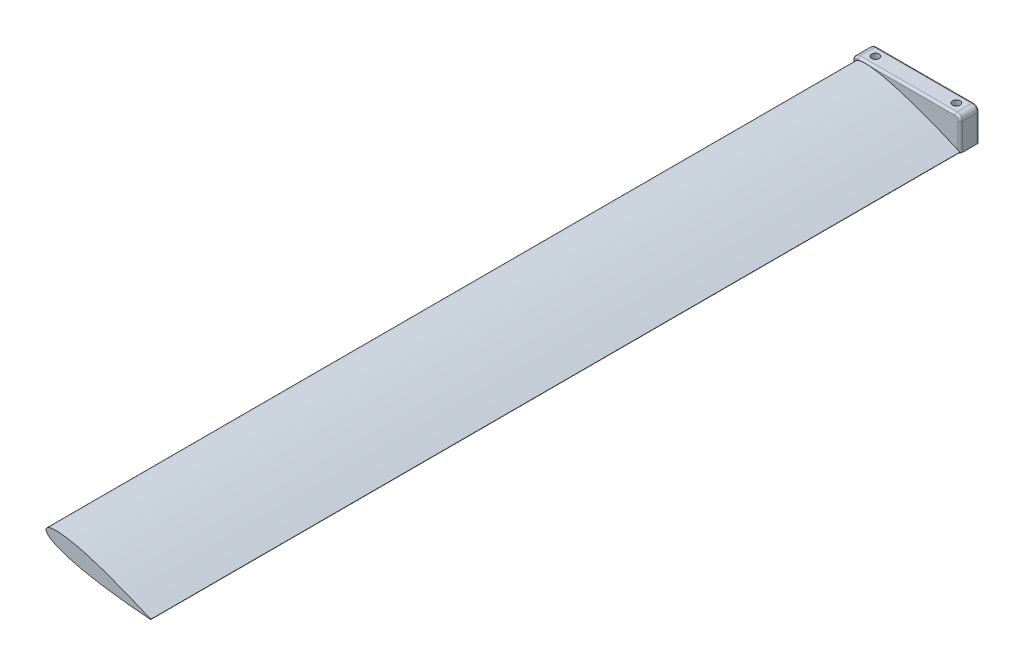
ISO-10303-21;
HEADER;
FILE_DESCRIPTION(('STEP AP214'),'2;1');
FILE_NAME('part.step','',(''),(''),'','','');
FILE_SCHEMA(('AUTOMOTIVE_DESIGN { 1 0 10303 214 1 1 1 1 }'));
ENDSEC;
DATA;
#1=APPLICATION_CONTEXT('core data for automotive mechanical design processes');
#2=APPLICATION_PROTOCOL_DEFINITION('international standard','automotive_design',2000,#1);
#3=PRODUCT_CONTEXT('',#1,'mechanical');
#4=PRODUCT('Part','Part','',(#3));
#5=PRODUCT_RELATED_PRODUCT_CATEGORY('part','',(#4));
#6=PRODUCT_DEFINITION_FORMATION('','',#4);
#7=PRODUCT_DEFINITION_CONTEXT('part definition',#1,'design');
#8=PRODUCT_DEFINITION('design','',#6,#7);
#9=PRODUCT_DEFINITION_SHAPE('','',#8);
#10=(LENGTH_UNIT() NAMED_UNIT(*) SI_UNIT(.MILLI.,.METRE.));
#11=(NAMED_UNIT(*) PLANE_ANGLE_UNIT() SI_UNIT($,.RADIAN.));
#12=(NAMED_UNIT(*) SI_UNIT($,.STERADIAN.) SOLID_ANGLE_UNIT());
#13=UNCERTAINTY_MEASURE_WITH_UNIT(LENGTH_MEASURE(1.E-05),#10,'distance_accuracy_value','');
#14=(GEOMETRIC_REPRESENTATION_CONTEXT(3) GLOBAL_UNCERTAINTY_ASSIGNED_CONTEXT((#13)) GLOBAL_UNIT_ASSIGNED_CONTEXT((#10,
#11,#12)) REPRESENTATION_CONTEXT('',''));
#15=CARTESIAN_POINT('',(0.,0.,0.));
#16=DIRECTION('',(0.,0.,1.));
#17=DIRECTION('',(1.,0.,0.));
#18=AXIS2_PLACEMENT_3D('',#15,#16,#17);
#19=CARTESIAN_POINT('',(6.13081109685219E-08,2.45893174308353E-07,0.));
#20=DIRECTION('',(0.,0.,-1.));
#21=DIRECTION('',(-1.,0.,0.));
#22=AXIS2_PLACEMENT_3D('',#19,#20,#21);
#23=PLANE('',#22);
#24=CARTESIAN_POINT('',(11.0904801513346,-2.76516726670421,0.));
#25=DIRECTION('',(0.,0.,-1.));
#26=DIRECTION('',(-1.,0.,0.));
#27=AXIS2_PLACEMENT_3D('',#24,#25,#26);
#28=CIRCLE('',#27,2.);
#29=CARTESIAN_POINT('',(9.09048015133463,-2.76516726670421,0.));
#30=VERTEX_POINT('',#29);
#31=EDGE_CURVE('E57',#30,#30,#28,.T.);
#32=ORIENTED_EDGE('',*,*,#31,.F.);
#33=EDGE_LOOP('',(#32));
#34=FACE_BOUND('',#33,.T.);
#35=CARTESIAN_POINT('',(19.7164091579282,-4.91585291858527,0.));
#36=DIRECTION('',(0.,0.,-1.));
#37=DIRECTION('',(-1.,0.,0.));
#38=AXIS2_PLACEMENT_3D('',#35,#36,#37);
#39=CIRCLE('',#38,2.);
#40=CARTESIAN_POINT('',(17.7164091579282,-4.91585291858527,0.));
#41=VERTEX_POINT('',#40);
#42=EDGE_CURVE('E177',#41,#41,#39,.T.);
#43=ORIENTED_EDGE('',*,*,#42,.F.);
#44=EDGE_LOOP('',(#43));
#45=FACE_BOUND('',#44,.T.);
#46=CARTESIAN_POINT('',(28.3423381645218,-7.06653857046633,0.));
#47=DIRECTION('',(0.,0.,-1.));
#48=DIRECTION('',(-1.,0.,0.));
#49=AXIS2_PLACEMENT_3D('',#46,#47,#48);
#50=CIRCLE('',#49,2.);
#51=CARTESIAN_POINT('',(26.3423381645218,-7.06653857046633,0.));
#52=VERTEX_POINT('',#51);
#53=EDGE_CURVE('E170',#52,#52,#50,.T.);
#54=ORIENTED_EDGE('',*,*,#53,.F.);
#55=EDGE_LOOP('',(#54));
#56=FACE_BOUND('',#55,.T.);
#57=CARTESIAN_POINT('',(49.310441,-12.211752,0.));
#58=CARTESIAN_POINT('',(48.5244228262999,-11.8657049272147,0.));
#59=CARTESIAN_POINT('',(46.9535992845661,-11.174144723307,0.));
#60=CARTESIAN_POINT('',(43.8001058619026,-9.83033649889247,0.));
#61=CARTESIAN_POINT('',(39.8445837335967,-8.20403911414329,0.));
#62=CARTESIAN_POINT('',(35.0751396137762,-6.33296193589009,0.));
#63=CARTESIAN_POINT('',(30.2849545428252,-4.54710908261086,0.));
#64=CARTESIAN_POINT('',(25.4693502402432,-2.86297778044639,0.));
#65=CARTESIAN_POINT('',(20.620100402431,-1.31046332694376,0.));
#66=CARTESIAN_POINT('',(16.5368800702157,-0.171497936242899,0.));
#67=CARTESIAN_POINT('',(13.2377727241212,0.603440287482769,0.));
#68=CARTESIAN_POINT('',(10.7400649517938,1.09667848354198,0.));
#69=CARTESIAN_POINT('',(8.21087812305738,1.47806359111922,0.));
#70=CARTESIAN_POINT('',(6.07206028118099,1.66242657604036,0.));
#71=CARTESIAN_POINT('',(4.33195767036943,1.68140741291,0.));
#72=CARTESIAN_POINT('',(2.98703440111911,1.60069763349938,0.));
#73=CARTESIAN_POINT('',(1.81994498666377,1.38674481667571,0.));
#74=CARTESIAN_POINT('',(0.721860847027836,0.992369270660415,0.));
#75=CARTESIAN_POINT('',(-0.283483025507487,0.0706801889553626,0.));
#76=CARTESIAN_POINT('',(0.171475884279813,-1.21510315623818,0.));
#77=CARTESIAN_POINT('',(0.955878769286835,-2.07883507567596,0.));
#78=CARTESIAN_POINT('',(1.88591289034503,-2.81565928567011,0.));
#79=CARTESIAN_POINT('',(3.03551868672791,-3.51832584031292,0.));
#80=CARTESIAN_POINT('',(4.5808487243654,-4.31849594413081,0.));
#81=CARTESIAN_POINT('',(6.55586614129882,-5.15982667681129,0.));
#82=CARTESIAN_POINT('',(8.96805485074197,-6.01046482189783,0.));
#83=CARTESIAN_POINT('',(11.4049616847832,-6.74756371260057,0.));
#84=CARTESIAN_POINT('',(14.6817120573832,-7.61217067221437,0.));
#85=CARTESIAN_POINT('',(18.8216932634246,-8.52348088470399,0.));
#86=CARTESIAN_POINT('',(23.8321882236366,-9.42927632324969,0.));
#87=CARTESIAN_POINT('',(28.8747663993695,-10.2030649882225,0.));
#88=CARTESIAN_POINT('',(33.9426557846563,-10.8751074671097,0.));
#89=CARTESIAN_POINT('',(39.0322424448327,-11.4621609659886,0.));
#90=CARTESIAN_POINT('',(43.2882612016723,-11.883233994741,0.));
#91=CARTESIAN_POINT('',(46.7035103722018,-12.1771949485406,0.));
#92=CARTESIAN_POINT('',(48.4151330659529,-12.3040403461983,0.));
#93=CARTESIAN_POINT('',(49.271605,-12.367512,0.));
#94=B_SPLINE_CURVE_WITH_KNOTS('',3,(#57,#58,#59,#60,#61,#62,#63,#64,#65,#66,#67,#68,#69,#70,#71,
#72,#73,#74,#75,#76,#77,#78,#79,#80,#81,#82,#83,#84,#85,#86,#87,#88,#89,#90,#91,#92,#93),
.UNSPECIFIED.,.F.,.F.,(4,1,1,1,1,1,1,1,1,1,1,1,1,1,1,1,1,1,1,1,1,1,1,1,1,1,1,1,1,1,1,1,1,1,4),
(0.,0.0246840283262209,0.0493299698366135,0.0985220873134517,0.147602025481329,
0.196578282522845,0.245450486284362,0.294218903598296,0.342903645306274,0.367241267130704,
0.391607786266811,0.416059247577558,0.440726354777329,0.453242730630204,0.466028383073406,
0.479472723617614,0.486972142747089,0.500000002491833,0.513027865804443,0.52052727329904,
0.533971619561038,0.546757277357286,0.559273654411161,0.583940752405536,0.60839221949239,
0.632758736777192,0.657096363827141,0.70578110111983,0.754549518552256,0.803421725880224,
0.852397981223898,0.901477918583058,0.950670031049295,0.975315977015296,1.),.UNSPECIFIED.);
#95=CARTESIAN_POINT('',(49.310441,-12.211752,0.));
#96=VERTEX_POINT('',#95);
#97=CARTESIAN_POINT('',(0.,0.,0.));
#98=VERTEX_POINT('',#97);
#99=EDGE_CURVE('E62',#96,#98,#94,.T.);
#100=ORIENTED_EDGE('',*,*,#99,.F.);
#101=CARTESIAN_POINT('',(49.271605,-12.367512,0.));
#102=CARTESIAN_POINT('',(49.294538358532,-12.3537323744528,0.));
#103=CARTESIAN_POINT('',(49.3156987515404,-12.3280892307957,0.));
#104=CARTESIAN_POINT('',(49.3308651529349,-12.2672611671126,0.));
#105=CARTESIAN_POINT('',(49.3242206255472,-12.234685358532,0.));
#106=CARTESIAN_POINT('',(49.310441,-12.211752,0.));
#107=B_SPLINE_CURVE_WITH_KNOTS('',3,(#101,#102,#103,#104,#105,#106),.UNSPECIFIED.,.F.,.F.,(4,2,
4),(0.,0.5,1.),.UNSPECIFIED.);
#108=CARTESIAN_POINT('',(49.271605,-12.367512,0.));
#109=VERTEX_POINT('',#108);
#110=EDGE_CURVE('E12',#109,#96,#107,.T.);
#111=ORIENTED_EDGE('',*,*,#110,.F.);
#112=CARTESIAN_POINT('',(49.310441,-12.211752,0.));
#113=CARTESIAN_POINT('',(48.5244228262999,-11.8657049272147,0.));
#114=CARTESIAN_POINT('',(46.9535992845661,-11.174144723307,0.));
#115=CARTESIAN_POINT('',(43.8001058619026,-9.83033649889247,0.));
#116=CARTESIAN_POINT('',(39.8445837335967,-8.20403911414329,0.));
#117=CARTESIAN_POINT('',(35.0751396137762,-6.33296193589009,0.));
#118=CARTESIAN_POINT('',(30.2849545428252,-4.54710908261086,0.));
#119=CARTESIAN_POINT('',(25.4693502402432,-2.86297778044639,0.));
#120=CARTESIAN_POINT('',(20.620100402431,-1.31046332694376,0.));
#121=CARTESIAN_POINT('',(16.5368800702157,-0.171497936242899,0.));
#122=CARTESIAN_POINT('',(13.2377727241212,0.603440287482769,0.));
#123=CARTESIAN_POINT('',(10.7400649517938,1.09667848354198,0.));
#124=CARTESIAN_POINT('',(8.21087812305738,1.47806359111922,0.));
#125=CARTESIAN_POINT('',(6.07206028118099,1.66242657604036,0.));
#126=CARTESIAN_POINT('',(4.33195767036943,1.68140741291,0.));
#127=CARTESIAN_POINT('',(2.98703440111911,1.60069763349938,0.));
#128=CARTESIAN_POINT('',(1.81994498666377,1.38674481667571,0.));
#129=CARTESIAN_POINT('',(0.721860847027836,0.992369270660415,0.));
#130=CARTESIAN_POINT('',(-0.283483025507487,0.0706801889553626,0.));
#131=CARTESIAN_POINT('',(0.171475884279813,-1.21510315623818,0.));
#132=CARTESIAN_POINT('',(0.955878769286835,-2.07883507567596,0.));
#133=CARTESIAN_POINT('',(1.88591289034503,-2.81565928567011,0.));
#134=CARTESIAN_POINT('',(3.03551868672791,-3.51832584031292,0.));
#135=CARTESIAN_POINT('',(4.5808487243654,-4.31849594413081,0.));
#136=CARTESIAN_POINT('',(6.55586614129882,-5.15982667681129,0.));
#137=CARTESIAN_POINT('',(8.96805485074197,-6.01046482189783,0.));
#138=CARTESIAN_POINT('',(11.4049616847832,-6.74756371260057,0.));
#139=CARTESIAN_POINT('',(14.6817120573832,-7.61217067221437,0.));
#140=CARTESIAN_POINT('',(18.8216932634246,-8.52348088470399,0.));
#141=CARTESIAN_POINT('',(23.8321882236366,-9.42927632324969,0.));
#142=CARTESIAN_POINT('',(28.8747663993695,-10.2030649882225,0.));
#143=CARTESIAN_POINT('',(33.9426557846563,-10.8751074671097,0.));
#144=CARTESIAN_POINT('',(39.0322424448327,-11.4621609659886,0.));
#145=CARTESIAN_POINT('',(43.2882612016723,-11.883233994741,0.));
#146=CARTESIAN_POINT('',(46.7035103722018,-12.1771949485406,0.));
#147=CARTESIAN_POINT('',(48.4151330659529,-12.3040403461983,0.));
#148=CARTESIAN_POINT('',(49.271605,-12.367512,0.));
#149=B_SPLINE_CURVE_WITH_KNOTS('',3,(#112,#113,#114,#115,#116,#117,#118,#119,#120,#121,#122,
#123,#124,#125,#126,#127,#128,#129,#130,#131,#132,#133,#134,#135,#136,#137,#138,#139,#140,#141,
#142,#143,#144,#145,#146,#147,#148),.UNSPECIFIED.,.F.,.F.,(4,1,1,1,1,1,1,1,1,1,1,1,1,1,1,1,1,1,
1,1,1,1,1,1,1,1,1,1,1,1,1,1,1,1,4),(0.,0.0246840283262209,0.0493299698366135,0.0985220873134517,
0.147602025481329,0.196578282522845,0.245450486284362,0.294218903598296,0.342903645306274,
0.367241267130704,0.391607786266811,0.416059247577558,0.440726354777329,0.453242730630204,
0.466028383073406,0.479472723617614,0.486972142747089,0.500000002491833,0.513027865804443,
0.52052727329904,0.533971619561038,0.546757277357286,0.559273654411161,0.583940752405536,
0.60839221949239,0.632758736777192,0.657096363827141,0.70578110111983,0.754549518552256,
0.803421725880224,0.852397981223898,0.901477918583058,0.950670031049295,0.975315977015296,1.),.UNSPECIFIED.);
#150=EDGE_CURVE('E157',#98,#109,#149,.T.);
#151=ORIENTED_EDGE('',*,*,#150,.F.);
#152=EDGE_LOOP('',(#100,#111,#151));
#153=FACE_BOUND('',#152,.T.);
#154=ADVANCED_FACE('F53',(#34,#45,#56,#153),#23,.T.);
#155=CARTESIAN_POINT('',(-0.00361128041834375,-0.00710369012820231,381.));
#156=DIRECTION('',(0.,0.,-1.));
#157=DIRECTION('',(-1.,0.,0.));
#158=AXIS2_PLACEMENT_3D('',#155,#156,#157);
#159=PLANE('',#158);
#160=CARTESIAN_POINT('',(49.2679936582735,-12.3746159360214,381.));
#161=CARTESIAN_POINT('',(48.4115217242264,-12.3111442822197,381.));
#162=CARTESIAN_POINT('',(46.6998990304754,-12.184298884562,381.));
#163=CARTESIAN_POINT('',(43.2846498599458,-11.8903379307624,381.));
#164=CARTESIAN_POINT('',(39.0286311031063,-11.4692649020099,381.));
#165=CARTESIAN_POINT('',(33.9390444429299,-10.882211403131,381.));
#166=CARTESIAN_POINT('',(28.871155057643,-10.2101689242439,381.));
#167=CARTESIAN_POINT('',(23.8285768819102,-9.43638025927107,381.));
#168=CARTESIAN_POINT('',(18.8180819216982,-8.53058482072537,381.));
#169=CARTESIAN_POINT('',(14.6781007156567,-7.61927460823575,381.));
#170=CARTESIAN_POINT('',(11.4013503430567,-6.75466764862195,381.));
#171=CARTESIAN_POINT('',(8.96444350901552,-6.01756875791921,381.));
#172=CARTESIAN_POINT('',(6.55225479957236,-5.16693061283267,381.));
#173=CARTESIAN_POINT('',(4.57723738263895,-4.32559988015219,381.));
#174=CARTESIAN_POINT('',(3.03190734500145,-3.5254297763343,381.));
#175=CARTESIAN_POINT('',(1.88230154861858,-2.82276322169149,381.));
#176=CARTESIAN_POINT('',(0.95226742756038,-2.08593901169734,381.));
#177=CARTESIAN_POINT('',(0.167864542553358,-1.22220709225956,381.));
#178=CARTESIAN_POINT('',(-0.287094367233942,0.0635762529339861,381.));
#179=CARTESIAN_POINT('',(0.718249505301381,0.985265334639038,381.));
#180=CARTESIAN_POINT('',(1.81633364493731,1.37964088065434,381.));
#181=CARTESIAN_POINT('',(2.98342305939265,1.593593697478,381.));
#182=CARTESIAN_POINT('',(4.32834632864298,1.67430347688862,381.));
#183=CARTESIAN_POINT('',(6.06844893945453,1.65532264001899,381.));
#184=CARTESIAN_POINT('',(8.20726678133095,1.47095965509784,381.));
#185=CARTESIAN_POINT('',(10.7364536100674,1.0895745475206,381.));
#186=CARTESIAN_POINT('',(13.2341613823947,0.596336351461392,381.));
#187=CARTESIAN_POINT('',(16.5332687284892,-0.178601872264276,381.));
#188=CARTESIAN_POINT('',(20.6164890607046,-1.31756726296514,381.));
#189=CARTESIAN_POINT('',(25.4657388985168,-2.87008171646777,381.));
#190=CARTESIAN_POINT('',(30.2813432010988,-4.55421301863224,381.));
#191=CARTESIAN_POINT('',(35.0715282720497,-6.34006587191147,381.));
#192=CARTESIAN_POINT('',(39.8409723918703,-8.21114305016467,381.));
#193=CARTESIAN_POINT('',(43.7964945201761,-9.83744043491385,381.));
#194=CARTESIAN_POINT('',(46.9499879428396,-11.1812486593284,381.));
#195=CARTESIAN_POINT('',(48.5208114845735,-11.8728088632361,381.));
#196=CARTESIAN_POINT('',(49.3068296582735,-12.2188559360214,381.));
#197=B_SPLINE_CURVE_WITH_KNOTS('',3,(#160,#161,#162,#163,#164,#165,#166,#167,#168,#169,#170,
#171,#172,#173,#174,#175,#176,#177,#178,#179,#180,#181,#182,#183,#184,#185,#186,#187,#188,#189,
#190,#191,#192,#193,#194,#195,#196),.UNSPECIFIED.,.F.,.F.,(4,1,1,1,1,1,1,1,1,1,1,1,1,1,1,1,1,1,
1,1,1,1,1,1,1,1,1,1,1,1,1,1,1,1,4),(0.,0.0246840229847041,0.049329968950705,0.0985220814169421,
0.147602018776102,0.196578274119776,0.245450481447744,0.29421889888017,0.342903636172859,
0.367241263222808,0.39160778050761,0.416059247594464,0.440726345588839,0.453242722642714,
0.466028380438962,0.47947272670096,0.486972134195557,0.499999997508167,0.513027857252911,
0.520527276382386,0.533971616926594,0.546757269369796,0.559273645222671,0.583940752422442,
0.608392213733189,0.632758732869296,0.657096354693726,0.705781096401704,0.754549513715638,
0.803421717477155,0.852397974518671,0.901477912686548,0.950670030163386,0.975315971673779,1.),.UNSPECIFIED.);
#198=CARTESIAN_POINT('',(49.3068296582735,-12.2188559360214,381.));
#199=VERTEX_POINT('',#198);
#200=CARTESIAN_POINT('',(49.2679936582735,-12.3746159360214,381.));
#201=VERTEX_POINT('',#200);
#202=EDGE_CURVE('E91',#199,#201,#197,.F.);
#203=ORIENTED_EDGE('',*,*,#202,.T.);
#204=CARTESIAN_POINT('',(49.3068296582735,-12.2188559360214,381.));
#205=CARTESIAN_POINT('',(49.3056977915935,-12.2455867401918,381.));
#206=CARTESIAN_POINT('',(49.301763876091,-12.2724601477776,381.));
#207=CARTESIAN_POINT('',(49.2886868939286,-12.3249081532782,381.));
#208=CARTESIAN_POINT('',(49.2795438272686,-12.350482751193,381.));
#209=CARTESIAN_POINT('',(49.2679936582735,-12.3746159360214,381.));
#210=B_SPLINE_CURVE_WITH_KNOTS('',3,(#204,#205,#206,#207,#208,#209),.UNSPECIFIED.,.F.,.F.,(4,2,
4),(0.,0.5,1.),.UNSPECIFIED.);
#211=EDGE_CURVE('E88',#201,#199,#210,.F.);
#212=ORIENTED_EDGE('',*,*,#211,.T.);
#213=EDGE_LOOP('',(#203,#212));
#214=FACE_BOUND('',#213,.T.);
#215=ADVANCED_FACE('F90',(#214),#159,.F.);
#216=CARTESIAN_POINT('',(49.3068296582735,-12.2188559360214,381.));
#217=CARTESIAN_POINT('',(49.310441,-12.211752,0.));
#218=CARTESIAN_POINT('',(49.3056977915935,-12.2455867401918,381.));
#219=CARTESIAN_POINT('',(49.3242206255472,-12.234685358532,0.));
#220=CARTESIAN_POINT('',(49.301763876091,-12.2724601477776,381.));
#221=CARTESIAN_POINT('',(49.3308651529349,-12.2672611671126,0.));
#222=CARTESIAN_POINT('',(49.2886868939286,-12.3249081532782,381.));
#223=CARTESIAN_POINT('',(49.3156987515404,-12.3280892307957,0.));
#224=CARTESIAN_POINT('',(49.2795438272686,-12.350482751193,381.));
#225=CARTESIAN_POINT('',(49.294538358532,-12.3537323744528,0.));
#226=CARTESIAN_POINT('',(49.2679936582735,-12.3746159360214,381.));
#227=CARTESIAN_POINT('',(49.271605,-12.367512,0.));
#228=B_SPLINE_SURFACE_WITH_KNOTS('',3,1,((#216,#217),(#218,#219),(#220,#221),(#222,#223),(#224,
#225),(#226,#227)),.UNSPECIFIED.,.F.,.F.,.F.,(4,2,4),(2,2),(0.,0.5,1.),(0.,1.),.UNSPECIFIED.);
#229=CARTESIAN_POINT('',(49.2679936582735,-12.3746159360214,381.));
#230=CARTESIAN_POINT('',(49.271605,-12.367512,0.));
#231=B_SPLINE_CURVE_WITH_KNOTS('',1,(#229,#230),.UNSPECIFIED.,.F.,.F.,(2,2),(0.,1.),.UNSPECIFIED.);
#232=EDGE_CURVE('E100',#201,#109,#231,.T.);
#233=CARTESIAN_POINT('',(49.310441,-12.211752,0.));
#234=CARTESIAN_POINT('',(49.3068296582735,-12.2188559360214,381.));
#235=B_SPLINE_CURVE_WITH_KNOTS('',1,(#233,#234),.UNSPECIFIED.,.F.,.F.,(2,2),(0.,1.),.UNSPECIFIED.);
#236=EDGE_CURVE('E69',#96,#199,#235,.T.);
#237=ORIENTED_EDGE('',*,*,#211,.F.);
#238=ORIENTED_EDGE('',*,*,#232,.T.);
#239=ORIENTED_EDGE('',*,*,#110,.T.);
#240=ORIENTED_EDGE('',*,*,#236,.T.);
#241=EDGE_LOOP('',(#237,#238,#239,#240));
#242=FACE_BOUND('',#241,.T.);
#243=ADVANCED_FACE('F105',(#242),#228,.T.);
#244=CARTESIAN_POINT('',(49.2679936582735,-12.3746159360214,381.));
#245=CARTESIAN_POINT('',(49.271605,-12.367512,0.));
#246=CARTESIAN_POINT('',(48.4115217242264,-12.3111442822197,381.));
#247=CARTESIAN_POINT('',(48.4151330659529,-12.3040403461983,0.));
#248=CARTESIAN_POINT('',(46.6998990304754,-12.184298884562,381.));
#249=CARTESIAN_POINT('',(46.7035103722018,-12.1771949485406,0.));
#250=CARTESIAN_POINT('',(43.2846498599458,-11.8903379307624,381.));
#251=CARTESIAN_POINT('',(43.2882612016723,-11.883233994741,0.));
#252=CARTESIAN_POINT('',(39.0286311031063,-11.4692649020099,381.));
#253=CARTESIAN_POINT('',(39.0322424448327,-11.4621609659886,0.));
#254=CARTESIAN_POINT('',(33.9390444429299,-10.882211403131,381.));
#255=CARTESIAN_POINT('',(33.9426557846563,-10.8751074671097,0.));
#256=CARTESIAN_POINT('',(28.871155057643,-10.2101689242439,381.));
#257=CARTESIAN_POINT('',(28.8747663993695,-10.2030649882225,0.));
#258=CARTESIAN_POINT('',(23.8285768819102,-9.43638025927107,381.));
#259=CARTESIAN_POINT('',(23.8321882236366,-9.42927632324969,0.));
#260=CARTESIAN_POINT('',(18.8180819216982,-8.53058482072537,381.));
#261=CARTESIAN_POINT('',(18.8216932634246,-8.52348088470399,0.));
#262=CARTESIAN_POINT('',(14.6781007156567,-7.61927460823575,381.));
#263=CARTESIAN_POINT('',(14.6817120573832,-7.61217067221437,0.));
#264=CARTESIAN_POINT('',(11.4013503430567,-6.75466764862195,381.));
#265=CARTESIAN_POINT('',(11.4049616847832,-6.74756371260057,0.));
#266=CARTESIAN_POINT('',(8.96444350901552,-6.01756875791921,381.));
#267=CARTESIAN_POINT('',(8.96805485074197,-6.01046482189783,0.));
#268=CARTESIAN_POINT('',(6.55225479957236,-5.16693061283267,381.));
#269=CARTESIAN_POINT('',(6.55586614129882,-5.15982667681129,0.));
#270=CARTESIAN_POINT('',(4.57723738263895,-4.32559988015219,381.));
#271=CARTESIAN_POINT('',(4.5808487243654,-4.31849594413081,0.));
#272=CARTESIAN_POINT('',(3.03190734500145,-3.5254297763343,381.));
#273=CARTESIAN_POINT('',(3.03551868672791,-3.51832584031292,0.));
#274=CARTESIAN_POINT('',(1.88230154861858,-2.82276322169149,381.));
#275=CARTESIAN_POINT('',(1.88591289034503,-2.81565928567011,0.));
#276=CARTESIAN_POINT('',(0.95226742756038,-2.08593901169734,381.));
#277=CARTESIAN_POINT('',(0.955878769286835,-2.07883507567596,0.));
#278=CARTESIAN_POINT('',(0.167864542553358,-1.22220709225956,381.));
#279=CARTESIAN_POINT('',(0.171475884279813,-1.21510315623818,0.));
#280=CARTESIAN_POINT('',(-0.287094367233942,0.0635762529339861,381.));
#281=CARTESIAN_POINT('',(-0.283483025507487,0.0706801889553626,0.));
#282=CARTESIAN_POINT('',(0.718249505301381,0.985265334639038,381.));
#283=CARTESIAN_POINT('',(0.721860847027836,0.992369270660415,0.));
#284=CARTESIAN_POINT('',(1.81633364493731,1.37964088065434,381.));
#285=CARTESIAN_POINT('',(1.81994498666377,1.38674481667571,0.));
#286=CARTESIAN_POINT('',(2.98342305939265,1.593593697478,381.));
#287=CARTESIAN_POINT('',(2.98703440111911,1.60069763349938,0.));
#288=CARTESIAN_POINT('',(4.32834632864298,1.67430347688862,381.));
#289=CARTESIAN_POINT('',(4.33195767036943,1.68140741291,0.));
#290=CARTESIAN_POINT('',(6.06844893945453,1.65532264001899,381.));
#291=CARTESIAN_POINT('',(6.07206028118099,1.66242657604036,0.));
#292=CARTESIAN_POINT('',(8.20726678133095,1.47095965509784,381.));
#293=CARTESIAN_POINT('',(8.21087812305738,1.47806359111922,0.));
#294=CARTESIAN_POINT('',(10.7364536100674,1.0895745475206,381.));
#295=CARTESIAN_POINT('',(10.7400649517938,1.09667848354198,0.));
#296=CARTESIAN_POINT('',(13.2341613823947,0.596336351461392,381.));
#297=CARTESIAN_POINT('',(13.2377727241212,0.603440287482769,0.));
#298=CARTESIAN_POINT('',(16.5332687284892,-0.178601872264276,381.));
#299=CARTESIAN_POINT('',(16.5368800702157,-0.171497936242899,0.));
#300=CARTESIAN_POINT('',(20.6164890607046,-1.31756726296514,381.));
#301=CARTESIAN_POINT('',(20.620100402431,-1.31046332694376,0.));
#302=CARTESIAN_POINT('',(25.4657388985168,-2.87008171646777,381.));
#303=CARTESIAN_POINT('',(25.4693502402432,-2.86297778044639,0.));
#304=CARTESIAN_POINT('',(30.2813432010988,-4.55421301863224,381.));
#305=CARTESIAN_POINT('',(30.2849545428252,-4.54710908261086,0.));
#306=CARTESIAN_POINT('',(35.0715282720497,-6.34006587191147,381.));
#307=CARTESIAN_POINT('',(35.0751396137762,-6.33296193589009,0.));
#308=CARTESIAN_POINT('',(39.8409723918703,-8.21114305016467,381.));
#309=CARTESIAN_POINT('',(39.8445837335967,-8.20403911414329,0.));
#310=CARTESIAN_POINT('',(43.7964945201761,-9.83744043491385,381.));
#311=CARTESIAN_POINT('',(43.8001058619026,-9.83033649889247,0.));
#312=CARTESIAN_POINT('',(46.9499879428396,-11.1812486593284,381.));
#313=CARTESIAN_POINT('',(46.9535992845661,-11.174144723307,0.));
#314=CARTESIAN_POINT('',(48.5208114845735,-11.8728088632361,381.));
#315=CARTESIAN_POINT('',(48.5244228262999,-11.8657049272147,0.));
#316=CARTESIAN_POINT('',(49.3068296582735,-12.2188559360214,381.));
#317=CARTESIAN_POINT('',(49.310441,-12.211752,0.));
#318=B_SPLINE_SURFACE_WITH_KNOTS('',3,1,((#244,#245),(#246,#247),(#248,#249),(#250,#251),(#252,
#253),(#254,#255),(#256,#257),(#258,#259),(#260,#261),(#262,#263),(#264,#265),(#266,#267),(#268,
#269),(#270,#271),(#272,#273),(#274,#275),(#276,#277),(#278,#279),(#280,#281),(#282,#283),(#284,
#285),(#286,#287),(#288,#289),(#290,#291),(#292,#293),(#294,#295),(#296,#297),(#298,#299),(#300,
#301),(#302,#303),(#304,#305),(#306,#307),(#308,#309),(#310,#311),(#312,#313),(#314,#315),(#316,
#317)),.UNSPECIFIED.,.F.,.F.,.F.,(4,1,1,1,1,1,1,1,1,1,1,1,1,1,1,1,1,1,1,1,1,1,1,1,1,1,1,1,1,1,1,
1,1,1,4),(2,2),(0.,0.0246840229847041,0.049329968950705,0.0985220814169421,0.147602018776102,
0.196578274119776,0.245450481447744,0.29421889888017,0.342903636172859,0.367241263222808,
0.39160778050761,0.416059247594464,0.440726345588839,0.453242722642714,0.466028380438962,
0.47947272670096,0.486972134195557,0.499999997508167,0.513027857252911,0.520527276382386,
0.533971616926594,0.546757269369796,0.559273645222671,0.583940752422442,0.608392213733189,
0.632758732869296,0.657096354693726,0.705781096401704,0.754549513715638,0.803421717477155,
0.852397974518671,0.901477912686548,0.950670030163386,0.975315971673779,1.),(0.,1.),.UNSPECIFIED.);
#319=ORIENTED_EDGE('',*,*,#202,.F.);
#320=ORIENTED_EDGE('',*,*,#236,.F.);
#321=ORIENTED_EDGE('',*,*,#99,.T.);
#322=ORIENTED_EDGE('',*,*,#150,.T.);
#323=ORIENTED_EDGE('',*,*,#232,.F.);
#324=EDGE_LOOP('',(#319,#320,#321,#322,#323));
#325=FACE_BOUND('',#324,.T.);
#326=ADVANCED_FACE('F99',(#325),#318,.T.);
#327=CARTESIAN_POINT('',(28.3423381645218,-7.06653857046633,31.11));
#328=DIRECTION('',(0.,0.,-1.));
#329=DIRECTION('',(-1.,0.,0.));
#330=AXIS2_PLACEMENT_3D('',#327,#328,#329);
#331=CYLINDRICAL_SURFACE('',#330,2.);
#332=ORIENTED_EDGE('',*,*,#53,.T.);
#333=EDGE_LOOP('',(#332));
#334=FACE_BOUND('',#333,.T.);
#335=CARTESIAN_POINT('',(28.3423381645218,-7.06653857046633,31.11));
#336=DIRECTION('',(0.,0.,-1.));
#337=DIRECTION('',(-1.,0.,0.));
#338=AXIS2_PLACEMENT_3D('',#335,#336,#337);
#339=CIRCLE('',#338,2.);
#340=CARTESIAN_POINT('',(26.3423381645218,-7.06653857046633,31.11));
#341=VERTEX_POINT('',#340);
#342=EDGE_CURVE('E200',#341,#341,#339,.T.);
#343=ORIENTED_EDGE('',*,*,#342,.F.);
#344=EDGE_LOOP('',(#343));
#345=FACE_BOUND('',#344,.T.);
#346=ADVANCED_FACE('F193',(#334,#345),#331,.F.);
#347=CARTESIAN_POINT('',(28.3423381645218,-7.06653857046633,31.11));
#348=DIRECTION('',(0.,0.,-1.));
#349=DIRECTION('',(-1.,0.,0.));
#350=AXIS2_PLACEMENT_3D('',#347,#348,#349);
#351=PLANE('',#350);
#352=ORIENTED_EDGE('',*,*,#342,.T.);
#353=EDGE_LOOP('',(#352));
#354=FACE_BOUND('',#353,.T.);
#355=ADVANCED_FACE('F196',(#354),#351,.T.);
#356=CARTESIAN_POINT('',(19.7164091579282,-4.91585291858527,31.11));
#357=DIRECTION('',(0.,0.,-1.));
#358=DIRECTION('',(-1.,0.,0.));
#359=AXIS2_PLACEMENT_3D('',#356,#357,#358);
#360=CYLINDRICAL_SURFACE('',#359,2.);
#361=ORIENTED_EDGE('',*,*,#42,.T.);
#362=EDGE_LOOP('',(#361));
#363=FACE_BOUND('',#362,.T.);
#364=CARTESIAN_POINT('',(19.7164091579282,-4.91585291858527,31.11));
#365=DIRECTION('',(0.,0.,-1.));
#366=DIRECTION('',(-1.,0.,0.));
#367=AXIS2_PLACEMENT_3D('',#364,#365,#366);
#368=CIRCLE('',#367,2.);
#369=CARTESIAN_POINT('',(17.7164091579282,-4.91585291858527,31.11));
#370=VERTEX_POINT('',#369);
#371=EDGE_CURVE('E202',#370,#370,#368,.T.);
#372=ORIENTED_EDGE('',*,*,#371,.F.);
#373=EDGE_LOOP('',(#372));
#374=FACE_BOUND('',#373,.T.);
#375=ADVANCED_FACE('F218',(#363,#374),#360,.F.);
#376=CARTESIAN_POINT('',(19.7164091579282,-4.91585291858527,31.11));
#377=DIRECTION('',(0.,0.,-1.));
#378=DIRECTION('',(-1.,0.,0.));
#379=AXIS2_PLACEMENT_3D('',#376,#377,#378);
#380=PLANE('',#379);
#381=ORIENTED_EDGE('',*,*,#371,.T.);
#382=EDGE_LOOP('',(#381));
#383=FACE_BOUND('',#382,.T.);
#384=ADVANCED_FACE('F211',(#383),#380,.T.);
#385=CARTESIAN_POINT('',(11.0904801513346,-2.76516726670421,31.11));
#386=DIRECTION('',(0.,0.,-1.));
#387=DIRECTION('',(-1.,0.,0.));
#388=AXIS2_PLACEMENT_3D('',#385,#386,#387);
#389=CYLINDRICAL_SURFACE('',#388,2.);
#390=ORIENTED_EDGE('',*,*,#31,.T.);
#391=EDGE_LOOP('',(#390));
#392=FACE_BOUND('',#391,.T.);
#393=CARTESIAN_POINT('',(11.0904801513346,-2.76516726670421,31.11));
#394=DIRECTION('',(0.,0.,-1.));
#395=DIRECTION('',(-1.,0.,0.));
#396=AXIS2_PLACEMENT_3D('',#393,#394,#395);
#397=CIRCLE('',#396,2.);
#398=CARTESIAN_POINT('',(9.09048015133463,-2.76516726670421,31.11));
#399=VERTEX_POINT('',#398);
#400=EDGE_CURVE('E178',#399,#399,#397,.T.);
#401=ORIENTED_EDGE('',*,*,#400,.F.);
#402=EDGE_LOOP('',(#401));
#403=FACE_BOUND('',#402,.T.);
#404=ADVANCED_FACE('F185',(#392,#403),#389,.F.);
#405=CARTESIAN_POINT('',(11.0904801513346,-2.76516726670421,31.11));
#406=DIRECTION('',(0.,0.,-1.));
#407=DIRECTION('',(-1.,0.,0.));
#408=AXIS2_PLACEMENT_3D('',#405,#406,#407);
#409=PLANE('',#408);
#410=ORIENTED_EDGE('',*,*,#400,.T.);
#411=EDGE_LOOP('',(#410));
#412=FACE_BOUND('',#411,.T.);
#413=ADVANCED_FACE('F209',(#412),#409,.T.);
#414=CLOSED_SHELL('',(#154,#215,#243,#326,#346,#355,#375,#384,#404,#413));
#415=MANIFOLD_SOLID_BREP('B2',#414);
#416=CARTESIAN_POINT('',(-1.27,2.54,-8.89));
#417=DIRECTION('',(-1.,0.,0.));
#418=DIRECTION('',(0.,-1.,0.));
#419=AXIS2_PLACEMENT_3D('',#416,#417,#418);
#420=PLANE('',#419);
#421=DIRECTION('',(0.,0.,1.));
#422=VECTOR('',#421,1.);
#423=CARTESIAN_POINT('',(-1.27,0.,-8.89));
#424=LINE('',#423,#422);
#425=CARTESIAN_POINT('',(-1.27,0.,-1.016));
#426=VERTEX_POINT('',#425);
#427=CARTESIAN_POINT('',(-1.27,0.,-7.874));
#428=VERTEX_POINT('',#427);
#429=EDGE_CURVE('E482',#426,#428,#424,.F.);
#430=ORIENTED_EDGE('',*,*,#429,.T.);
#431=DIRECTION('',(0.,-1.,0.));
#432=VECTOR('',#431,1.);
#433=CARTESIAN_POINT('',(-1.27,-12.7,-7.874));
#434=LINE('',#433,#432);
#435=CARTESIAN_POINT('',(-1.27,-12.7,-7.874));
#436=VERTEX_POINT('',#435);
#437=EDGE_CURVE('E488',#428,#436,#434,.T.);
#438=ORIENTED_EDGE('',*,*,#437,.T.);
#439=DIRECTION('',(0.,0.,1.));
#440=VECTOR('',#439,1.);
#441=CARTESIAN_POINT('',(-1.27,-12.7,-8.89));
#442=LINE('',#441,#440);
#443=CARTESIAN_POINT('',(-1.27,-12.7,-1.016));
#444=VERTEX_POINT('',#443);
#445=EDGE_CURVE('E485',#436,#444,#442,.T.);
#446=ORIENTED_EDGE('',*,*,#445,.T.);
#447=DIRECTION('',(0.,-1.,0.));
#448=VECTOR('',#447,1.);
#449=CARTESIAN_POINT('',(-1.27,2.54,-1.016));
#450=LINE('',#449,#448);
#451=EDGE_CURVE('E479',#444,#426,#450,.F.);
#452=ORIENTED_EDGE('',*,*,#451,.T.);
#453=EDGE_LOOP('',(#430,#438,#446,#452));
#454=FACE_BOUND('',#453,.T.);
#455=ADVANCED_FACE('F388',(#454),#420,.T.);
#456=CARTESIAN_POINT('',(-1.27,2.54,-8.89));
#457=DIRECTION('',(0.,-1.,0.));
#458=DIRECTION('',(1.,0.,0.));
#459=AXIS2_PLACEMENT_3D('',#456,#457,#458);
#460=PLANE('',#459);
#461=CARTESIAN_POINT('',(43.18,2.54,-4.445));
#462=DIRECTION('',(0.,1.,0.));
#463=DIRECTION('',(0.,0.,1.));
#464=AXIS2_PLACEMENT_3D('',#461,#462,#463);
#465=CIRCLE('',#464,1.7907);
#466=CARTESIAN_POINT('',(43.18,2.54,-2.6543));
#467=VERTEX_POINT('',#466);
#468=EDGE_CURVE('E561',#467,#467,#465,.T.);
#469=ORIENTED_EDGE('',*,*,#468,.F.);
#470=EDGE_LOOP('',(#469));
#471=FACE_BOUND('',#470,.T.);
#472=CARTESIAN_POINT('',(5.08,2.54,-4.445));
#473=DIRECTION('',(0.,1.,0.));
#474=DIRECTION('',(0.,0.,1.));
#475=AXIS2_PLACEMENT_3D('',#472,#473,#474);
#476=CIRCLE('',#475,1.7907);
#477=CARTESIAN_POINT('',(5.08,2.54,-2.6543));
#478=VERTEX_POINT('',#477);
#479=EDGE_CURVE('E567',#478,#478,#476,.T.);
#480=ORIENTED_EDGE('',*,*,#479,.F.);
#481=EDGE_LOOP('',(#480));
#482=FACE_BOUND('',#481,.T.);
#483=DIRECTION('',(0.,0.,1.));
#484=VECTOR('',#483,1.);
#485=CARTESIAN_POINT('',(46.99,2.54,-8.89));
#486=LINE('',#485,#484);
#487=CARTESIAN_POINT('',(46.99,2.54,-1.016));
#488=VERTEX_POINT('',#487);
#489=CARTESIAN_POINT('',(46.99,2.54,-7.874));
#490=VERTEX_POINT('',#489);
#491=EDGE_CURVE('E498',#488,#490,#486,.F.);
#492=ORIENTED_EDGE('',*,*,#491,.T.);
#493=DIRECTION('',(1.,0.,0.));
#494=VECTOR('',#493,1.);
#495=CARTESIAN_POINT('',(-1.27,2.54,-7.874));
#496=LINE('',#495,#494);
#497=CARTESIAN_POINT('',(1.27,2.54,-7.874));
#498=VERTEX_POINT('',#497);
#499=EDGE_CURVE('E607',#490,#498,#496,.F.);
#500=ORIENTED_EDGE('',*,*,#499,.T.);
#501=DIRECTION('',(0.,0.,1.));
#502=VECTOR('',#501,1.);
#503=CARTESIAN_POINT('',(1.27,2.54,0.));
#504=LINE('',#503,#502);
#505=CARTESIAN_POINT('',(1.27,2.54,-1.016));
#506=VERTEX_POINT('',#505);
#507=EDGE_CURVE('E582',#498,#506,#504,.T.);
#508=ORIENTED_EDGE('',*,*,#507,.T.);
#509=DIRECTION('',(1.,0.,0.));
#510=VECTOR('',#509,1.);
#511=CARTESIAN_POINT('',(46.99,2.54,-1.016));
#512=LINE('',#511,#510);
#513=EDGE_CURVE('E605',#506,#488,#512,.T.);
#514=ORIENTED_EDGE('',*,*,#513,.T.);
#515=EDGE_LOOP('',(#492,#500,#508,#514));
#516=FACE_BOUND('',#515,.T.);
#517=ADVANCED_FACE('F657',(#471,#482,#516),#460,.F.);
#518=CARTESIAN_POINT('',(49.53,2.54,-8.89));
#519=DIRECTION('',(-1.,0.,0.));
#520=DIRECTION('',(0.,0.,1.));
#521=AXIS2_PLACEMENT_3D('',#518,#519,#520);
#522=PLANE('',#521);
#523=DIRECTION('',(0.,0.,1.));
#524=VECTOR('',#523,1.);
#525=CARTESIAN_POINT('',(49.53,-12.7,-8.89));
#526=LINE('',#525,#524);
#527=CARTESIAN_POINT('',(49.53,-12.7,-7.874));
#528=VERTEX_POINT('',#527);
#529=CARTESIAN_POINT('',(49.53,-12.7,-1.016));
#530=VERTEX_POINT('',#529);
#531=EDGE_CURVE('E575',#528,#530,#526,.T.);
#532=ORIENTED_EDGE('',*,*,#531,.F.);
#533=DIRECTION('',(0.,-1.,0.));
#534=VECTOR('',#533,1.);
#535=CARTESIAN_POINT('',(49.53,2.54,-7.874));
#536=LINE('',#535,#534);
#537=CARTESIAN_POINT('',(49.53,0.,-7.874));
#538=VERTEX_POINT('',#537);
#539=EDGE_CURVE('E51',#528,#538,#536,.F.);
#540=ORIENTED_EDGE('',*,*,#539,.T.);
#541=DIRECTION('',(0.,0.,1.));
#542=VECTOR('',#541,1.);
#543=CARTESIAN_POINT('',(49.53,0.,-8.89));
#544=LINE('',#543,#542);
#545=CARTESIAN_POINT('',(49.53,0.,-1.016));
#546=VERTEX_POINT('',#545);
#547=EDGE_CURVE('E578',#538,#546,#544,.T.);
#548=ORIENTED_EDGE('',*,*,#547,.T.);
#549=DIRECTION('',(0.,-1.,0.));
#550=VECTOR('',#549,1.);
#551=CARTESIAN_POINT('',(49.53,-12.7,-1.016));
#552=LINE('',#551,#550);
#553=EDGE_CURVE('E397',#546,#530,#552,.T.);
#554=ORIENTED_EDGE('',*,*,#553,.T.);
#555=EDGE_LOOP('',(#532,#540,#548,#554));
#556=FACE_BOUND('',#555,.T.);
#557=ADVANCED_FACE('F683',(#556),#522,.F.);
#558=CARTESIAN_POINT('',(-1.27,-12.7,-8.89));
#559=DIRECTION('',(0.,-1.,0.));
#560=DIRECTION('',(0.,0.,-1.));
#561=AXIS2_PLACEMENT_3D('',#558,#559,#560);
#562=PLANE('',#561);
#563=CARTESIAN_POINT('',(43.18,-12.7,-4.445));
#564=DIRECTION('',(0.,1.,0.));
#565=DIRECTION('',(0.,0.,1.));
#566=AXIS2_PLACEMENT_3D('',#563,#564,#565);
#567=CIRCLE('',#566,1.7907);
#568=CARTESIAN_POINT('',(43.18,-12.7,-2.6543));
#569=VERTEX_POINT('',#568);
#570=EDGE_CURVE('E557',#569,#569,#567,.T.);
#571=ORIENTED_EDGE('',*,*,#570,.T.);
#572=EDGE_LOOP('',(#571));
#573=FACE_BOUND('',#572,.T.);
#574=CARTESIAN_POINT('',(5.08,-12.7,-4.445));
#575=DIRECTION('',(0.,1.,0.));
#576=DIRECTION('',(0.,0.,1.));
#577=AXIS2_PLACEMENT_3D('',#574,#575,#576);
#578=CIRCLE('',#577,1.7907);
#579=CARTESIAN_POINT('',(5.08,-12.7,-2.6543));
#580=VERTEX_POINT('',#579);
#581=EDGE_CURVE('E564',#580,#580,#578,.T.);
#582=ORIENTED_EDGE('',*,*,#581,.T.);
#583=EDGE_LOOP('',(#582));
#584=FACE_BOUND('',#583,.T.);
#585=ORIENTED_EDGE('',*,*,#445,.F.);
#586=CARTESIAN_POINT('',(-0.253999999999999,-12.7,-7.874));
#587=DIRECTION('',(0.,-1.,0.));
#588=DIRECTION('',(0.,0.,-1.));
#589=AXIS2_PLACEMENT_3D('',#586,#587,#588);
#590=CIRCLE('',#589,1.016);
#591=CARTESIAN_POINT('',(-0.253999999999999,-12.7,-8.89));
#592=VERTEX_POINT('',#591);
#593=EDGE_CURVE('E593',#436,#592,#590,.T.);
#594=ORIENTED_EDGE('',*,*,#593,.T.);
#595=DIRECTION('',(1.,0.,0.));
#596=VECTOR('',#595,1.);
#597=CARTESIAN_POINT('',(-1.27,-12.7,-8.89));
#598=LINE('',#597,#596);
#599=CARTESIAN_POINT('',(48.514,-12.7,-8.89));
#600=VERTEX_POINT('',#599);
#601=EDGE_CURVE('E570',#592,#600,#598,.T.);
#602=ORIENTED_EDGE('',*,*,#601,.T.);
#603=CARTESIAN_POINT('',(48.514,-12.7,-7.874));
#604=DIRECTION('',(0.,-1.,0.));
#605=DIRECTION('',(0.,0.,-1.));
#606=AXIS2_PLACEMENT_3D('',#603,#604,#605);
#607=CIRCLE('',#606,1.016);
#608=EDGE_CURVE('E589',#600,#528,#607,.T.);
#609=ORIENTED_EDGE('',*,*,#608,.T.);
#610=ORIENTED_EDGE('',*,*,#531,.T.);
#611=CARTESIAN_POINT('',(48.514,-12.7,-1.016));
#612=DIRECTION('',(0.,-1.,0.));
#613=DIRECTION('',(0.,0.,-1.));
#614=AXIS2_PLACEMENT_3D('',#611,#612,#613);
#615=CIRCLE('',#614,1.016);
#616=CARTESIAN_POINT('',(48.514,-12.7,0.));
#617=VERTEX_POINT('',#616);
#618=EDGE_CURVE('E587',#530,#617,#615,.T.);
#619=ORIENTED_EDGE('',*,*,#618,.T.);
#620=DIRECTION('',(1.,0.,0.));
#621=VECTOR('',#620,1.);
#622=CARTESIAN_POINT('',(-1.27,-12.7,0.));
#623=LINE('',#622,#621);
#624=CARTESIAN_POINT('',(-0.253999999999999,-12.7,0.));
#625=VERTEX_POINT('',#624);
#626=EDGE_CURVE('E560',#625,#617,#623,.T.);
#627=ORIENTED_EDGE('',*,*,#626,.F.);
#628=CARTESIAN_POINT('',(-0.253999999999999,-12.7,-1.016));
#629=DIRECTION('',(0.,-1.,0.));
#630=DIRECTION('',(0.,0.,-1.));
#631=AXIS2_PLACEMENT_3D('',#628,#629,#630);
#632=CIRCLE('',#631,1.016);
#633=EDGE_CURVE('E591',#625,#444,#632,.T.);
#634=ORIENTED_EDGE('',*,*,#633,.T.);
#635=EDGE_LOOP('',(#585,#594,#602,#609,#610,#619,#627,#634));
#636=FACE_BOUND('',#635,.T.);
#637=ADVANCED_FACE('F646',(#573,#584,#636),#562,.T.);
#638=CARTESIAN_POINT('',(0.,0.,-8.89));
#639=DIRECTION('',(0.,0.,1.));
#640=DIRECTION('',(1.,0.,0.));
#641=AXIS2_PLACEMENT_3D('',#638,#639,#640);
#642=PLANE('',#641);
#643=CARTESIAN_POINT('',(11.0904801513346,-2.76516726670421,-8.89));
#644=DIRECTION('',(0.,0.,-1.));
#645=DIRECTION('',(-1.,0.,0.));
#646=AXIS2_PLACEMENT_3D('',#643,#644,#645);
#647=CIRCLE('',#646,2.);
#648=CARTESIAN_POINT('',(9.09048015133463,-2.76516726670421,-8.89));
#649=VERTEX_POINT('',#648);
#650=EDGE_CURVE('E527',#649,#649,#647,.T.);
#651=ORIENTED_EDGE('',*,*,#650,.F.);
#652=EDGE_LOOP('',(#651));
#653=FACE_BOUND('',#652,.T.);
#654=CARTESIAN_POINT('',(19.7164091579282,-4.91585291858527,-8.89));
#655=DIRECTION('',(0.,0.,-1.));
#656=DIRECTION('',(-1.,0.,0.));
#657=AXIS2_PLACEMENT_3D('',#654,#655,#656);
#658=CIRCLE('',#657,2.);
#659=CARTESIAN_POINT('',(17.7164091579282,-4.91585291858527,-8.89));
#660=VERTEX_POINT('',#659);
#661=EDGE_CURVE('E551',#660,#660,#658,.T.);
#662=ORIENTED_EDGE('',*,*,#661,.F.);
#663=EDGE_LOOP('',(#662));
#664=FACE_BOUND('',#663,.T.);
#665=CARTESIAN_POINT('',(28.3423381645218,-7.06653857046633,-8.89));
#666=DIRECTION('',(0.,0.,-1.));
#667=DIRECTION('',(-1.,0.,0.));
#668=AXIS2_PLACEMENT_3D('',#665,#666,#667);
#669=CIRCLE('',#668,2.);
#670=CARTESIAN_POINT('',(26.3423381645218,-7.06653857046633,-8.89));
#671=VERTEX_POINT('',#670);
#672=EDGE_CURVE('E549',#671,#671,#669,.T.);
#673=ORIENTED_EDGE('',*,*,#672,.F.);
#674=EDGE_LOOP('',(#673));
#675=FACE_BOUND('',#674,.T.);
#676=ORIENTED_EDGE('',*,*,#601,.F.);
#677=DIRECTION('',(0.,-1.,0.));
#678=VECTOR('',#677,1.);
#679=CARTESIAN_POINT('',(-0.254,0.,-8.89));
#680=LINE('',#679,#678);
#681=CARTESIAN_POINT('',(-0.254,0.,-8.89));
#682=VERTEX_POINT('',#681);
#683=EDGE_CURVE('E506',#592,#682,#680,.F.);
#684=ORIENTED_EDGE('',*,*,#683,.T.);
#685=CARTESIAN_POINT('',(1.27,0.,-8.89));
#686=DIRECTION('',(0.,0.,1.));
#687=DIRECTION('',(1.,0.,0.));
#688=AXIS2_PLACEMENT_3D('',#685,#686,#687);
#689=CIRCLE('',#688,1.524);
#690=CARTESIAN_POINT('',(1.27,1.524,-8.89));
#691=VERTEX_POINT('',#690);
#692=EDGE_CURVE('E601',#682,#691,#689,.F.);
#693=ORIENTED_EDGE('',*,*,#692,.T.);
#694=DIRECTION('',(1.,0.,0.));
#695=VECTOR('',#694,1.);
#696=CARTESIAN_POINT('',(0.,1.524,-8.89));
#697=LINE('',#696,#695);
#698=CARTESIAN_POINT('',(46.99,1.524,-8.89));
#699=VERTEX_POINT('',#698);
#700=EDGE_CURVE('E599',#691,#699,#697,.T.);
#701=ORIENTED_EDGE('',*,*,#700,.T.);
#702=CARTESIAN_POINT('',(46.99,0.,-8.89));
#703=DIRECTION('',(0.,0.,1.));
#704=DIRECTION('',(1.,0.,0.));
#705=AXIS2_PLACEMENT_3D('',#702,#703,#704);
#706=CIRCLE('',#705,1.524);
#707=CARTESIAN_POINT('',(48.514,0.,-8.89));
#708=VERTEX_POINT('',#707);
#709=EDGE_CURVE('E597',#699,#708,#706,.F.);
#710=ORIENTED_EDGE('',*,*,#709,.T.);
#711=DIRECTION('',(0.,-1.,0.));
#712=VECTOR('',#711,1.);
#713=CARTESIAN_POINT('',(48.514,0.,-8.89));
#714=LINE('',#713,#712);
#715=EDGE_CURVE('E595',#708,#600,#714,.T.);
#716=ORIENTED_EDGE('',*,*,#715,.T.);
#717=EDGE_LOOP('',(#676,#684,#693,#701,#710,#716));
#718=FACE_BOUND('',#717,.T.);
#719=ADVANCED_FACE('F538',(#653,#664,#675,#718),#642,.F.);
#720=CARTESIAN_POINT('',(0.,0.,0.));
#721=DIRECTION('',(0.,0.,1.));
#722=DIRECTION('',(1.,0.,0.));
#723=AXIS2_PLACEMENT_3D('',#720,#721,#722);
#724=PLANE('',#723);
#725=CARTESIAN_POINT('',(11.0904801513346,-2.76516726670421,0.));
#726=DIRECTION('',(0.,0.,1.));
#727=DIRECTION('',(1.,0.,0.));
#728=AXIS2_PLACEMENT_3D('',#725,#726,#727);
#729=CIRCLE('',#728,2.);
#730=CARTESIAN_POINT('',(13.0904801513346,-2.76516726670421,0.));
#731=VERTEX_POINT('',#730);
#732=EDGE_CURVE('E392',#731,#731,#729,.T.);
#733=ORIENTED_EDGE('',*,*,#732,.F.);
#734=EDGE_LOOP('',(#733));
#735=FACE_BOUND('',#734,.T.);
#736=CARTESIAN_POINT('',(19.7164091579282,-4.91585291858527,0.));
#737=DIRECTION('',(0.,0.,1.));
#738=DIRECTION('',(1.,0.,0.));
#739=AXIS2_PLACEMENT_3D('',#736,#737,#738);
#740=CIRCLE('',#739,2.);
#741=CARTESIAN_POINT('',(21.7164091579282,-4.91585291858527,0.));
#742=VERTEX_POINT('',#741);
#743=EDGE_CURVE('E514',#742,#742,#740,.T.);
#744=ORIENTED_EDGE('',*,*,#743,.F.);
#745=EDGE_LOOP('',(#744));
#746=FACE_BOUND('',#745,.T.);
#747=CARTESIAN_POINT('',(28.3423381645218,-7.06653857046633,0.));
#748=DIRECTION('',(0.,0.,1.));
#749=DIRECTION('',(1.,0.,0.));
#750=AXIS2_PLACEMENT_3D('',#747,#748,#749);
#751=CIRCLE('',#750,2.);
#752=CARTESIAN_POINT('',(30.3423381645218,-7.06653857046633,0.));
#753=VERTEX_POINT('',#752);
#754=EDGE_CURVE('E525',#753,#753,#751,.T.);
#755=ORIENTED_EDGE('',*,*,#754,.F.);
#756=EDGE_LOOP('',(#755));
#757=FACE_BOUND('',#756,.T.);
#758=CARTESIAN_POINT('',(1.27,0.,0.));
#759=DIRECTION('',(0.,0.,1.));
#760=DIRECTION('',(1.,0.,0.));
#761=AXIS2_PLACEMENT_3D('',#758,#759,#760);
#762=CIRCLE('',#761,1.524);
#763=CARTESIAN_POINT('',(1.27,1.524,0.));
#764=VERTEX_POINT('',#763);
#765=CARTESIAN_POINT('',(-0.254,0.,0.));
#766=VERTEX_POINT('',#765);
#767=EDGE_CURVE('E405',#764,#766,#762,.T.);
#768=ORIENTED_EDGE('',*,*,#767,.T.);
#769=DIRECTION('',(0.,-1.,0.));
#770=VECTOR('',#769,1.);
#771=CARTESIAN_POINT('',(-0.254,0.,0.));
#772=LINE('',#771,#770);
#773=EDGE_CURVE('E509',#766,#625,#772,.T.);
#774=ORIENTED_EDGE('',*,*,#773,.T.);
#775=ORIENTED_EDGE('',*,*,#626,.T.);
#776=DIRECTION('',(0.,-1.,0.));
#777=VECTOR('',#776,1.);
#778=CARTESIAN_POINT('',(48.514,0.,0.));
#779=LINE('',#778,#777);
#780=CARTESIAN_POINT('',(48.514,0.,0.));
#781=VERTEX_POINT('',#780);
#782=EDGE_CURVE('E613',#617,#781,#779,.F.);
#783=ORIENTED_EDGE('',*,*,#782,.T.);
#784=CARTESIAN_POINT('',(46.99,0.,0.));
#785=DIRECTION('',(0.,0.,1.));
#786=DIRECTION('',(1.,0.,0.));
#787=AXIS2_PLACEMENT_3D('',#784,#785,#786);
#788=CIRCLE('',#787,1.524);
#789=CARTESIAN_POINT('',(46.99,1.524,0.));
#790=VERTEX_POINT('',#789);
#791=EDGE_CURVE('E615',#781,#790,#788,.T.);
#792=ORIENTED_EDGE('',*,*,#791,.T.);
#793=DIRECTION('',(1.,0.,0.));
#794=VECTOR('',#793,1.);
#795=CARTESIAN_POINT('',(1.27,1.524,0.));
#796=LINE('',#795,#794);
#797=EDGE_CURVE('E410',#790,#764,#796,.F.);
#798=ORIENTED_EDGE('',*,*,#797,.T.);
#799=EDGE_LOOP('',(#768,#774,#775,#783,#792,#798));
#800=FACE_BOUND('',#799,.T.);
#801=ADVANCED_FACE('F534',(#735,#746,#757,#800),#724,.T.);
#802=CARTESIAN_POINT('',(5.08,-12.7,-4.445));
#803=DIRECTION('',(0.,1.,0.));
#804=DIRECTION('',(0.,0.,1.));
#805=AXIS2_PLACEMENT_3D('',#802,#803,#804);
#806=CYLINDRICAL_SURFACE('',#805,1.7907);
#807=CARTESIAN_POINT('',(5.08,-12.7,-2.6543));
#808=CARTESIAN_POINT('',(5.08,-12.54125,-2.6543));
#809=CARTESIAN_POINT('',(5.08,-12.3825,-2.6543));
#810=CARTESIAN_POINT('',(5.08,-12.065,-2.6543));
#811=CARTESIAN_POINT('',(5.08,-11.90625,-2.6543));
#812=CARTESIAN_POINT('',(5.08,-11.58875,-2.6543));
#813=CARTESIAN_POINT('',(5.08,-11.43,-2.6543));
#814=CARTESIAN_POINT('',(5.08,-11.1125,-2.6543));
#815=CARTESIAN_POINT('',(5.08,-10.95375,-2.6543));
#816=CARTESIAN_POINT('',(5.08,-10.63625,-2.6543));
#817=CARTESIAN_POINT('',(5.08,-10.4775,-2.6543));
#818=CARTESIAN_POINT('',(5.08,-10.16,-2.6543));
#819=CARTESIAN_POINT('',(5.08,-10.00125,-2.6543));
#820=CARTESIAN_POINT('',(5.08,-9.68375,-2.6543));
#821=CARTESIAN_POINT('',(5.08,-9.525,-2.6543));
#822=CARTESIAN_POINT('',(5.08,-9.2075,-2.6543));
#823=CARTESIAN_POINT('',(5.08,-9.04875,-2.6543));
#824=CARTESIAN_POINT('',(5.08,-8.73125,-2.6543));
#825=CARTESIAN_POINT('',(5.08,-8.5725,-2.6543));
#826=CARTESIAN_POINT('',(5.08,-8.255,-2.6543));
#827=CARTESIAN_POINT('',(5.08,-8.09625,-2.6543));
#828=CARTESIAN_POINT('',(5.08,-7.77875,-2.6543));
#829=CARTESIAN_POINT('',(5.08,-7.62,-2.6543));
#830=CARTESIAN_POINT('',(5.08,-7.3025,-2.6543));
#831=CARTESIAN_POINT('',(5.08,-7.14375,-2.6543));
#832=CARTESIAN_POINT('',(5.08,-6.82625,-2.6543));
#833=CARTESIAN_POINT('',(5.08,-6.6675,-2.6543));
#834=CARTESIAN_POINT('',(5.08,-6.35,-2.6543));
#835=CARTESIAN_POINT('',(5.08,-6.19125,-2.6543));
#836=CARTESIAN_POINT('',(5.08,-5.87375,-2.6543));
#837=CARTESIAN_POINT('',(5.08,-5.715,-2.6543));
#838=CARTESIAN_POINT('',(5.08,-5.3975,-2.6543));
#839=CARTESIAN_POINT('',(5.08,-5.23875,-2.6543));
#840=CARTESIAN_POINT('',(5.08,-4.92125,-2.6543));
#841=CARTESIAN_POINT('',(5.08,-4.7625,-2.6543));
#842=CARTESIAN_POINT('',(5.08,-4.445,-2.6543));
#843=CARTESIAN_POINT('',(5.08,-4.28625,-2.6543));
#844=CARTESIAN_POINT('',(5.08,-3.96875,-2.6543));
#845=CARTESIAN_POINT('',(5.08,-3.81,-2.6543));
#846=CARTESIAN_POINT('',(5.08,-3.4925,-2.6543));
#847=CARTESIAN_POINT('',(5.08,-3.33375,-2.6543));
#848=CARTESIAN_POINT('',(5.08,-3.01625,-2.6543));
#849=CARTESIAN_POINT('',(5.08,-2.8575,-2.6543));
#850=CARTESIAN_POINT('',(5.08,-2.54,-2.6543));
#851=CARTESIAN_POINT('',(5.08,-2.38125,-2.6543));
#852=CARTESIAN_POINT('',(5.08,-2.06375,-2.6543));
#853=CARTESIAN_POINT('',(5.08,-1.905,-2.6543));
#854=CARTESIAN_POINT('',(5.08,-1.5875,-2.6543));
#855=CARTESIAN_POINT('',(5.08,-1.42875,-2.6543));
#856=CARTESIAN_POINT('',(5.08,-1.11125,-2.6543));
#857=CARTESIAN_POINT('',(5.08,-0.9525,-2.6543));
#858=CARTESIAN_POINT('',(5.08,-0.635,-2.6543));
#859=CARTESIAN_POINT('',(5.08,-0.47625,-2.6543));
#860=CARTESIAN_POINT('',(5.08,-0.15875,-2.6543));
#861=CARTESIAN_POINT('',(5.08,0.,-2.6543));
#862=CARTESIAN_POINT('',(5.08,0.317500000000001,-2.6543));
#863=CARTESIAN_POINT('',(5.08,0.47625,-2.6543));
#864=CARTESIAN_POINT('',(5.08,0.793750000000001,-2.6543));
#865=CARTESIAN_POINT('',(5.08,0.952500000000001,-2.6543));
#866=CARTESIAN_POINT('',(5.08,1.27,-2.6543));
#867=CARTESIAN_POINT('',(5.08,1.42875,-2.6543));
#868=CARTESIAN_POINT('',(5.08,1.74625,-2.6543));
#869=CARTESIAN_POINT('',(5.08,1.905,-2.6543));
#870=CARTESIAN_POINT('',(5.08,2.2225,-2.6543));
#871=CARTESIAN_POINT('',(5.08,2.38125,-2.6543));
#872=CARTESIAN_POINT('',(5.08,2.54,-2.6543));
#873=B_SPLINE_CURVE_WITH_KNOTS('',3,(#807,#808,#809,#810,#811,#812,#813,#814,#815,#816,#817,
#818,#819,#820,#821,#822,#823,#824,#825,#826,#827,#828,#829,#830,#831,#832,#833,#834,#835,#836,
#837,#838,#839,#840,#841,#842,#843,#844,#845,#846,#847,#848,#849,#850,#851,#852,#853,#854,#855,
#856,#857,#858,#859,#860,#861,#862,#863,#864,#865,#866,#867,#868,#869,#870,#871,#872),
.UNSPECIFIED.,.F.,.F.,(4,2,2,2,2,2,2,2,2,2,2,2,2,2,2,2,2,2,2,2,2,2,2,2,2,2,2,2,2,2,2,2,4),(0.,
0.476250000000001,0.9525,1.42875,1.905,2.38125,2.8575,3.33375,3.81,4.28625,4.7625,5.23875,5.715,
6.19125,6.6675,7.14375,7.62,8.09625,8.5725,9.04875,9.525,10.00125,10.4775,10.95375,11.43,
11.90625,12.3825,12.85875,13.335,13.81125,14.2875,14.76375,15.24),.UNSPECIFIED.);
#874=EDGE_CURVE('BSEAM537',#580,#478,#873,.T.);
#875=ORIENTED_EDGE('',*,*,#581,.F.);
#876=ORIENTED_EDGE('',*,*,#479,.T.);
#877=ORIENTED_EDGE('',*,*,#874,.T.);
#878=ORIENTED_EDGE('',*,*,#874,.F.);
#879=EDGE_LOOP('',(#875,#877,#876,#878));
#880=FACE_BOUND('',#879,.T.);
#881=ADVANCED_FACE('F537',(#880),#806,.F.);
#882=CARTESIAN_POINT('',(43.18,-12.7,-4.445));
#883=DIRECTION('',(0.,1.,0.));
#884=DIRECTION('',(0.,0.,1.));
#885=AXIS2_PLACEMENT_3D('',#882,#883,#884);
#886=CYLINDRICAL_SURFACE('',#885,1.7907);
#887=CARTESIAN_POINT('',(43.18,-12.7,-2.6543));
#888=CARTESIAN_POINT('',(43.18,-12.54125,-2.6543));
#889=CARTESIAN_POINT('',(43.18,-12.3825,-2.6543));
#890=CARTESIAN_POINT('',(43.18,-12.065,-2.6543));
#891=CARTESIAN_POINT('',(43.18,-11.90625,-2.6543));
#892=CARTESIAN_POINT('',(43.18,-11.58875,-2.6543));
#893=CARTESIAN_POINT('',(43.18,-11.43,-2.6543));
#894=CARTESIAN_POINT('',(43.18,-11.1125,-2.6543));
#895=CARTESIAN_POINT('',(43.18,-10.95375,-2.6543));
#896=CARTESIAN_POINT('',(43.18,-10.63625,-2.6543));
#897=CARTESIAN_POINT('',(43.18,-10.4775,-2.6543));
#898=CARTESIAN_POINT('',(43.18,-10.16,-2.6543));
#899=CARTESIAN_POINT('',(43.18,-10.00125,-2.6543));
#900=CARTESIAN_POINT('',(43.18,-9.68375,-2.6543));
#901=CARTESIAN_POINT('',(43.18,-9.525,-2.6543));
#902=CARTESIAN_POINT('',(43.18,-9.2075,-2.6543));
#903=CARTESIAN_POINT('',(43.18,-9.04875,-2.6543));
#904=CARTESIAN_POINT('',(43.18,-8.73125,-2.6543));
#905=CARTESIAN_POINT('',(43.18,-8.5725,-2.6543));
#906=CARTESIAN_POINT('',(43.18,-8.255,-2.6543));
#907=CARTESIAN_POINT('',(43.18,-8.09625,-2.6543));
#908=CARTESIAN_POINT('',(43.18,-7.77875,-2.6543));
#909=CARTESIAN_POINT('',(43.18,-7.62,-2.6543));
#910=CARTESIAN_POINT('',(43.18,-7.3025,-2.6543));
#911=CARTESIAN_POINT('',(43.18,-7.14375,-2.6543));
#912=CARTESIAN_POINT('',(43.18,-6.82625,-2.6543));
#913=CARTESIAN_POINT('',(43.18,-6.6675,-2.6543));
#914=CARTESIAN_POINT('',(43.18,-6.35,-2.6543));
#915=CARTESIAN_POINT('',(43.18,-6.19125,-2.6543));
#916=CARTESIAN_POINT('',(43.18,-5.87375,-2.6543));
#917=CARTESIAN_POINT('',(43.18,-5.715,-2.6543));
#918=CARTESIAN_POINT('',(43.18,-5.3975,-2.6543));
#919=CARTESIAN_POINT('',(43.18,-5.23875,-2.6543));
#920=CARTESIAN_POINT('',(43.18,-4.92125,-2.6543));
#921=CARTESIAN_POINT('',(43.18,-4.7625,-2.6543));
#922=CARTESIAN_POINT('',(43.18,-4.445,-2.6543));
#923=CARTESIAN_POINT('',(43.18,-4.28625,-2.6543));
#924=CARTESIAN_POINT('',(43.18,-3.96875,-2.6543));
#925=CARTESIAN_POINT('',(43.18,-3.81,-2.6543));
#926=CARTESIAN_POINT('',(43.18,-3.4925,-2.6543));
#927=CARTESIAN_POINT('',(43.18,-3.33375,-2.6543));
#928=CARTESIAN_POINT('',(43.18,-3.01625,-2.6543));
#929=CARTESIAN_POINT('',(43.18,-2.8575,-2.6543));
#930=CARTESIAN_POINT('',(43.18,-2.54,-2.6543));
#931=CARTESIAN_POINT('',(43.18,-2.38125,-2.6543));
#932=CARTESIAN_POINT('',(43.18,-2.06375,-2.6543));
#933=CARTESIAN_POINT('',(43.18,-1.905,-2.6543));
#934=CARTESIAN_POINT('',(43.18,-1.5875,-2.6543));
#935=CARTESIAN_POINT('',(43.18,-1.42875,-2.6543));
#936=CARTESIAN_POINT('',(43.18,-1.11125,-2.6543));
#937=CARTESIAN_POINT('',(43.18,-0.9525,-2.6543));
#938=CARTESIAN_POINT('',(43.18,-0.635,-2.6543));
#939=CARTESIAN_POINT('',(43.18,-0.47625,-2.6543));
#940=CARTESIAN_POINT('',(43.18,-0.15875,-2.6543));
#941=CARTESIAN_POINT('',(43.18,0.,-2.6543));
#942=CARTESIAN_POINT('',(43.18,0.317500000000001,-2.6543));
#943=CARTESIAN_POINT('',(43.18,0.47625,-2.6543));
#944=CARTESIAN_POINT('',(43.18,0.793750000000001,-2.6543));
#945=CARTESIAN_POINT('',(43.18,0.952500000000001,-2.6543));
#946=CARTESIAN_POINT('',(43.18,1.27,-2.6543));
#947=CARTESIAN_POINT('',(43.18,1.42875,-2.6543));
#948=CARTESIAN_POINT('',(43.18,1.74625,-2.6543));
#949=CARTESIAN_POINT('',(43.18,1.905,-2.6543));
#950=CARTESIAN_POINT('',(43.18,2.2225,-2.6543));
#951=CARTESIAN_POINT('',(43.18,2.38125,-2.6543));
#952=CARTESIAN_POINT('',(43.18,2.54,-2.6543));
#953=B_SPLINE_CURVE_WITH_KNOTS('',3,(#887,#888,#889,#890,#891,#892,#893,#894,#895,#896,#897,
#898,#899,#900,#901,#902,#903,#904,#905,#906,#907,#908,#909,#910,#911,#912,#913,#914,#915,#916,
#917,#918,#919,#920,#921,#922,#923,#924,#925,#926,#927,#928,#929,#930,#931,#932,#933,#934,#935,
#936,#937,#938,#939,#940,#941,#942,#943,#944,#945,#946,#947,#948,#949,#950,#951,#952),
.UNSPECIFIED.,.F.,.F.,(4,2,2,2,2,2,2,2,2,2,2,2,2,2,2,2,2,2,2,2,2,2,2,2,2,2,2,2,2,2,2,2,4),(0.,
0.476250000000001,0.9525,1.42875,1.905,2.38125,2.8575,3.33375,3.81,4.28625,4.7625,5.23875,5.715,
6.19125,6.6675,7.14375,7.62,8.09625,8.5725,9.04875,9.525,10.00125,10.4775,10.95375,11.43,
11.90625,12.3825,12.85875,13.335,13.81125,14.2875,14.76375,15.24),.UNSPECIFIED.);
#954=EDGE_CURVE('BSEAM691',#569,#467,#953,.T.);
#955=ORIENTED_EDGE('',*,*,#570,.F.);
#956=ORIENTED_EDGE('',*,*,#468,.T.);
#957=ORIENTED_EDGE('',*,*,#954,.T.);
#958=ORIENTED_EDGE('',*,*,#954,.F.);
#959=EDGE_LOOP('',(#955,#957,#956,#958));
#960=FACE_BOUND('',#959,.T.);
#961=ADVANCED_FACE('F691',(#960),#886,.F.);
#962=CARTESIAN_POINT('',(46.99,0.,-8.89));
#963=DIRECTION('',(0.,0.,1.));
#964=DIRECTION('',(1.,0.,0.));
#965=AXIS2_PLACEMENT_3D('',#962,#963,#964);
#966=CYLINDRICAL_SURFACE('',#965,2.54);
#967=ORIENTED_EDGE('',*,*,#547,.F.);
#968=CARTESIAN_POINT('',(46.99,0.,-7.874));
#969=DIRECTION('',(0.,0.,1.));
#970=DIRECTION('',(1.,0.,0.));
#971=AXIS2_PLACEMENT_3D('',#968,#969,#970);
#972=CIRCLE('',#971,2.54);
#973=EDGE_CURVE('E611',#538,#490,#972,.T.);
#974=ORIENTED_EDGE('',*,*,#973,.T.);
#975=ORIENTED_EDGE('',*,*,#491,.F.);
#976=CARTESIAN_POINT('',(46.99,0.,-1.016));
#977=DIRECTION('',(0.,0.,1.));
#978=DIRECTION('',(1.,0.,0.));
#979=AXIS2_PLACEMENT_3D('',#976,#977,#978);
#980=CIRCLE('',#979,2.54);
#981=EDGE_CURVE('E609',#488,#546,#980,.F.);
#982=ORIENTED_EDGE('',*,*,#981,.T.);
#983=EDGE_LOOP('',(#967,#974,#975,#982));
#984=FACE_BOUND('',#983,.T.);
#985=ADVANCED_FACE('F663',(#984),#966,.T.);
#986=CARTESIAN_POINT('',(1.27,0.,-8.89));
#987=DIRECTION('',(0.,0.,-1.));
#988=DIRECTION('',(-1.,0.,0.));
#989=AXIS2_PLACEMENT_3D('',#986,#987,#988);
#990=CYLINDRICAL_SURFACE('',#989,2.54);
#991=ORIENTED_EDGE('',*,*,#507,.F.);
#992=CARTESIAN_POINT('',(1.27,0.,-7.874));
#993=DIRECTION('',(0.,0.,1.));
#994=DIRECTION('',(1.,0.,0.));
#995=AXIS2_PLACEMENT_3D('',#992,#993,#994);
#996=CIRCLE('',#995,2.54);
#997=EDGE_CURVE('E497',#498,#428,#996,.T.);
#998=ORIENTED_EDGE('',*,*,#997,.T.);
#999=ORIENTED_EDGE('',*,*,#429,.F.);
#1000=CARTESIAN_POINT('',(1.27,0.,-1.016));
#1001=DIRECTION('',(0.,0.,1.));
#1002=DIRECTION('',(1.,0.,0.));
#1003=AXIS2_PLACEMENT_3D('',#1000,#1001,#1002);
#1004=CIRCLE('',#1003,2.54);
#1005=EDGE_CURVE('E494',#426,#506,#1004,.F.);
#1006=ORIENTED_EDGE('',*,*,#1005,.T.);
#1007=EDGE_LOOP('',(#991,#998,#999,#1006));
#1008=FACE_BOUND('',#1007,.T.);
#1009=ADVANCED_FACE('F493',(#1008),#990,.T.);
#1010=CARTESIAN_POINT('',(48.514,0.,-7.874));
#1011=DIRECTION('',(0.,-1.,0.));
#1012=DIRECTION('',(0.,0.,-1.));
#1013=AXIS2_PLACEMENT_3D('',#1010,#1011,#1012);
#1014=CYLINDRICAL_SURFACE('',#1013,1.016);
#1015=ORIENTED_EDGE('',*,*,#608,.F.);
#1016=ORIENTED_EDGE('',*,*,#715,.F.);
#1017=CARTESIAN_POINT('',(48.514,0.,-7.874));
#1018=DIRECTION('',(0.,1.,0.));
#1019=DIRECTION('',(0.,0.,1.));
#1020=AXIS2_PLACEMENT_3D('',#1017,#1018,#1019);
#1021=CIRCLE('',#1020,1.016);
#1022=EDGE_CURVE('E516',#538,#708,#1021,.T.);
#1023=ORIENTED_EDGE('',*,*,#1022,.F.);
#1024=ORIENTED_EDGE('',*,*,#539,.F.);
#1025=EDGE_LOOP('',(#1015,#1016,#1023,#1024));
#1026=FACE_BOUND('',#1025,.T.);
#1027=ADVANCED_FACE('F641',(#1026),#1014,.T.);
#1028=CARTESIAN_POINT('',(46.99,0.,-7.874));
#1029=DIRECTION('',(0.,0.,1.));
#1030=DIRECTION('',(1.,0.,0.));
#1031=AXIS2_PLACEMENT_3D('',#1028,#1029,#1030);
#1032=TOROIDAL_SURFACE('',#1031,1.524,1.016);
#1033=ORIENTED_EDGE('',*,*,#1022,.T.);
#1034=ORIENTED_EDGE('',*,*,#709,.F.);
#1035=CARTESIAN_POINT('',(46.99,1.524,-7.874));
#1036=DIRECTION('',(-1.,0.,0.));
#1037=DIRECTION('',(0.,0.,1.));
#1038=AXIS2_PLACEMENT_3D('',#1035,#1036,#1037);
#1039=CIRCLE('',#1038,1.016);
#1040=EDGE_CURVE('E625',#490,#699,#1039,.T.);
#1041=ORIENTED_EDGE('',*,*,#1040,.F.);
#1042=ORIENTED_EDGE('',*,*,#973,.F.);
#1043=EDGE_LOOP('',(#1033,#1034,#1041,#1042));
#1044=FACE_BOUND('',#1043,.T.);
#1045=ADVANCED_FACE('F636',(#1044),#1032,.T.);
#1046=CARTESIAN_POINT('',(0.,1.524,-7.874));
#1047=DIRECTION('',(1.,0.,0.));
#1048=DIRECTION('',(0.,1.,0.));
#1049=AXIS2_PLACEMENT_3D('',#1046,#1047,#1048);
#1050=CYLINDRICAL_SURFACE('',#1049,1.016);
#1051=ORIENTED_EDGE('',*,*,#1040,.T.);
#1052=ORIENTED_EDGE('',*,*,#700,.F.);
#1053=CARTESIAN_POINT('',(1.27,1.524,-7.874));
#1054=DIRECTION('',(-1.,0.,0.));
#1055=DIRECTION('',(0.,0.,1.));
#1056=AXIS2_PLACEMENT_3D('',#1053,#1054,#1055);
#1057=CIRCLE('',#1056,1.016);
#1058=EDGE_CURVE('E623',#498,#691,#1057,.T.);
#1059=ORIENTED_EDGE('',*,*,#1058,.F.);
#1060=ORIENTED_EDGE('',*,*,#499,.F.);
#1061=EDGE_LOOP('',(#1051,#1052,#1059,#1060));
#1062=FACE_BOUND('',#1061,.T.);
#1063=ADVANCED_FACE('F655',(#1062),#1050,.T.);
#1064=CARTESIAN_POINT('',(1.27,0.,-7.874));
#1065=DIRECTION('',(0.,0.,1.));
#1066=DIRECTION('',(1.,0.,0.));
#1067=AXIS2_PLACEMENT_3D('',#1064,#1065,#1066);
#1068=TOROIDAL_SURFACE('',#1067,1.524,1.016);
#1069=ORIENTED_EDGE('',*,*,#1058,.T.);
#1070=ORIENTED_EDGE('',*,*,#692,.F.);
#1071=CARTESIAN_POINT('',(-0.254,0.,-7.874));
#1072=DIRECTION('',(0.,-1.,0.));
#1073=DIRECTION('',(1.,0.,0.));
#1074=AXIS2_PLACEMENT_3D('',#1071,#1072,#1073);
#1075=CIRCLE('',#1074,1.016);
#1076=EDGE_CURVE('E524',#428,#682,#1075,.T.);
#1077=ORIENTED_EDGE('',*,*,#1076,.F.);
#1078=ORIENTED_EDGE('',*,*,#997,.F.);
#1079=EDGE_LOOP('',(#1069,#1070,#1077,#1078));
#1080=FACE_BOUND('',#1079,.T.);
#1081=ADVANCED_FACE('F653',(#1080),#1068,.T.);
#1082=CARTESIAN_POINT('',(-0.254000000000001,2.54,-7.874));
#1083=DIRECTION('',(0.,1.,0.));
#1084=DIRECTION('',(-1.,0.,0.));
#1085=AXIS2_PLACEMENT_3D('',#1082,#1083,#1084);
#1086=CYLINDRICAL_SURFACE('',#1085,1.016);
#1087=ORIENTED_EDGE('',*,*,#1076,.T.);
#1088=ORIENTED_EDGE('',*,*,#683,.F.);
#1089=ORIENTED_EDGE('',*,*,#593,.F.);
#1090=ORIENTED_EDGE('',*,*,#437,.F.);
#1091=EDGE_LOOP('',(#1087,#1088,#1089,#1090));
#1092=FACE_BOUND('',#1091,.T.);
#1093=ADVANCED_FACE('F650',(#1092),#1086,.T.);
#1094=CARTESIAN_POINT('',(48.514,2.54,-1.016));
#1095=DIRECTION('',(0.,1.,0.));
#1096=DIRECTION('',(0.,0.,1.));
#1097=AXIS2_PLACEMENT_3D('',#1094,#1095,#1096);
#1098=CYLINDRICAL_SURFACE('',#1097,1.016);
#1099=ORIENTED_EDGE('',*,*,#618,.F.);
#1100=ORIENTED_EDGE('',*,*,#553,.F.);
#1101=CARTESIAN_POINT('',(48.514,0.,-1.016));
#1102=DIRECTION('',(0.,1.,0.));
#1103=DIRECTION('',(0.,0.,1.));
#1104=AXIS2_PLACEMENT_3D('',#1101,#1102,#1103);
#1105=CIRCLE('',#1104,1.016);
#1106=EDGE_CURVE('E521',#781,#546,#1105,.T.);
#1107=ORIENTED_EDGE('',*,*,#1106,.F.);
#1108=ORIENTED_EDGE('',*,*,#782,.F.);
#1109=EDGE_LOOP('',(#1099,#1100,#1107,#1108));
#1110=FACE_BOUND('',#1109,.T.);
#1111=ADVANCED_FACE('F390',(#1110),#1098,.T.);
#1112=CARTESIAN_POINT('',(46.99,0.,-1.016));
#1113=DIRECTION('',(0.,0.,1.));
#1114=DIRECTION('',(1.,0.,0.));
#1115=AXIS2_PLACEMENT_3D('',#1112,#1113,#1114);
#1116=TOROIDAL_SURFACE('',#1115,1.524,1.016);
#1117=ORIENTED_EDGE('',*,*,#1106,.T.);
#1118=ORIENTED_EDGE('',*,*,#981,.F.);
#1119=CARTESIAN_POINT('',(46.99,1.524,-1.016));
#1120=DIRECTION('',(-1.,0.,0.));
#1121=DIRECTION('',(0.,0.,1.));
#1122=AXIS2_PLACEMENT_3D('',#1119,#1120,#1121);
#1123=CIRCLE('',#1122,1.016);
#1124=EDGE_CURVE('E511',#790,#488,#1123,.T.);
#1125=ORIENTED_EDGE('',*,*,#1124,.F.);
#1126=ORIENTED_EDGE('',*,*,#791,.F.);
#1127=EDGE_LOOP('',(#1117,#1118,#1125,#1126));
#1128=FACE_BOUND('',#1127,.T.);
#1129=ADVANCED_FACE('F666',(#1128),#1116,.T.);
#1130=CARTESIAN_POINT('',(-1.27,1.524,-1.016));
#1131=DIRECTION('',(-1.,0.,0.));
#1132=DIRECTION('',(0.,-1.,0.));
#1133=AXIS2_PLACEMENT_3D('',#1130,#1131,#1132);
#1134=CYLINDRICAL_SURFACE('',#1133,1.016);
#1135=ORIENTED_EDGE('',*,*,#1124,.T.);
#1136=ORIENTED_EDGE('',*,*,#513,.F.);
#1137=CARTESIAN_POINT('',(1.27,1.524,-1.016));
#1138=DIRECTION('',(-1.,0.,0.));
#1139=DIRECTION('',(0.,0.,1.));
#1140=AXIS2_PLACEMENT_3D('',#1137,#1138,#1139);
#1141=CIRCLE('',#1140,1.016);
#1142=EDGE_CURVE('E505',#764,#506,#1141,.T.);
#1143=ORIENTED_EDGE('',*,*,#1142,.F.);
#1144=ORIENTED_EDGE('',*,*,#797,.F.);
#1145=EDGE_LOOP('',(#1135,#1136,#1143,#1144));
#1146=FACE_BOUND('',#1145,.T.);
#1147=ADVANCED_FACE('F670',(#1146),#1134,.T.);
#1148=CARTESIAN_POINT('',(1.27,0.,-1.016));
#1149=DIRECTION('',(0.,0.,1.));
#1150=DIRECTION('',(1.,0.,0.));
#1151=AXIS2_PLACEMENT_3D('',#1148,#1149,#1150);
#1152=TOROIDAL_SURFACE('',#1151,1.524,1.016);
#1153=ORIENTED_EDGE('',*,*,#1142,.T.);
#1154=ORIENTED_EDGE('',*,*,#1005,.F.);
#1155=CARTESIAN_POINT('',(-0.254,0.,-1.016));
#1156=DIRECTION('',(0.,-1.,0.));
#1157=DIRECTION('',(1.,0.,0.));
#1158=AXIS2_PLACEMENT_3D('',#1155,#1156,#1157);
#1159=CIRCLE('',#1158,1.016);
#1160=EDGE_CURVE('E503',#766,#426,#1159,.T.);
#1161=ORIENTED_EDGE('',*,*,#1160,.F.);
#1162=ORIENTED_EDGE('',*,*,#767,.F.);
#1163=EDGE_LOOP('',(#1153,#1154,#1161,#1162));
#1164=FACE_BOUND('',#1163,.T.);
#1165=ADVANCED_FACE('F502',(#1164),#1152,.T.);
#1166=CARTESIAN_POINT('',(-0.254,0.,-1.016));
#1167=DIRECTION('',(0.,-1.,0.));
#1168=DIRECTION('',(1.,0.,0.));
#1169=AXIS2_PLACEMENT_3D('',#1166,#1167,#1168);
#1170=CYLINDRICAL_SURFACE('',#1169,1.016);
#1171=ORIENTED_EDGE('',*,*,#1160,.T.);
#1172=ORIENTED_EDGE('',*,*,#451,.F.);
#1173=ORIENTED_EDGE('',*,*,#633,.F.);
#1174=ORIENTED_EDGE('',*,*,#773,.F.);
#1175=EDGE_LOOP('',(#1171,#1172,#1173,#1174));
#1176=FACE_BOUND('',#1175,.T.);
#1177=ADVANCED_FACE('F508',(#1176),#1170,.T.);
#1178=CARTESIAN_POINT('',(28.3423381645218,-7.06653857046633,31.11));
#1179=DIRECTION('',(0.,0.,-1.));
#1180=DIRECTION('',(-1.,0.,0.));
#1181=AXIS2_PLACEMENT_3D('',#1178,#1179,#1180);
#1182=CYLINDRICAL_SURFACE('',#1181,2.);
#1183=ORIENTED_EDGE('',*,*,#754,.T.);
#1184=EDGE_LOOP('',(#1183));
#1185=FACE_BOUND('',#1184,.T.);
#1186=ORIENTED_EDGE('',*,*,#672,.T.);
#1187=EDGE_LOOP('',(#1186));
#1188=FACE_BOUND('',#1187,.T.);
#1189=ADVANCED_FACE('F543',(#1185,#1188),#1182,.F.);
#1190=CARTESIAN_POINT('',(19.7164091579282,-4.91585291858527,31.11));
#1191=DIRECTION('',(0.,0.,-1.));
#1192=DIRECTION('',(-1.,0.,0.));
#1193=AXIS2_PLACEMENT_3D('',#1190,#1191,#1192);
#1194=CYLINDRICAL_SURFACE('',#1193,2.);
#1195=ORIENTED_EDGE('',*,*,#743,.T.);
#1196=EDGE_LOOP('',(#1195));
#1197=FACE_BOUND('',#1196,.T.);
#1198=ORIENTED_EDGE('',*,*,#661,.T.);
#1199=EDGE_LOOP('',(#1198));
#1200=FACE_BOUND('',#1199,.T.);
#1201=ADVANCED_FACE('F531',(#1197,#1200),#1194,.F.);
#1202=CARTESIAN_POINT('',(11.0904801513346,-2.76516726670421,31.11));
#1203=DIRECTION('',(0.,0.,-1.));
#1204=DIRECTION('',(-1.,0.,0.));
#1205=AXIS2_PLACEMENT_3D('',#1202,#1203,#1204);
#1206=CYLINDRICAL_SURFACE('',#1205,2.);
#1207=ORIENTED_EDGE('',*,*,#732,.T.);
#1208=EDGE_LOOP('',(#1207));
#1209=FACE_BOUND('',#1208,.T.);
#1210=ORIENTED_EDGE('',*,*,#650,.T.);
#1211=EDGE_LOOP('',(#1210));
#1212=FACE_BOUND('',#1211,.T.);
#1213=ADVANCED_FACE('F721',(#1209,#1212),#1206,.F.);
#1214=CLOSED_SHELL('',(#455,#517,#557,#637,#719,#801,#881,#961,#985,#1009,#1027,#1045,#1063,
#1081,#1093,#1111,#1129,#1147,#1165,#1177,#1189,#1201,#1213));
#1215=MANIFOLD_SOLID_BREP('B6',#1214);
#1216=ADVANCED_BREP_SHAPE_REPRESENTATION('',(#18,#415,#1215),#14);
#1217=SHAPE_DEFINITION_REPRESENTATION(#9,#1216);
ENDSEC;
END-ISO-10303-21;
